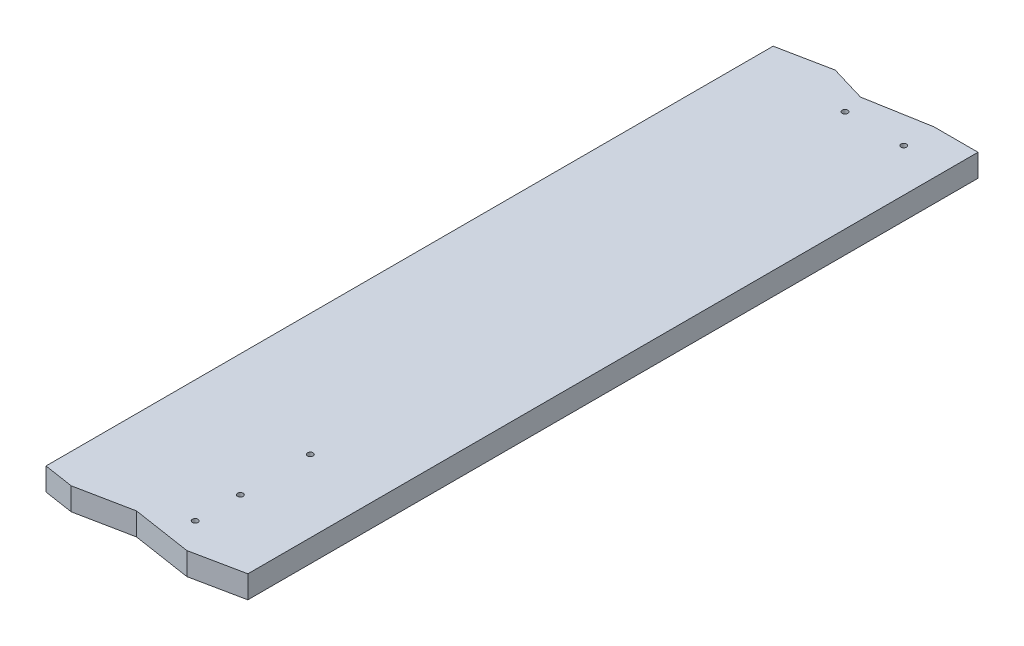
ISO-10303-21;
HEADER;
FILE_DESCRIPTION(('STEP AP214'),'2;1');
FILE_NAME('part.step','',(''),(''),'','','');
FILE_SCHEMA(('AUTOMOTIVE_DESIGN { 1 0 10303 214 1 1 1 1 }'));
ENDSEC;
DATA;
#1=APPLICATION_CONTEXT('core data for automotive mechanical design processes');
#2=APPLICATION_PROTOCOL_DEFINITION('international standard','automotive_design',2000,#1);
#3=PRODUCT_CONTEXT('',#1,'mechanical');
#4=PRODUCT('Part','Part','',(#3));
#5=PRODUCT_RELATED_PRODUCT_CATEGORY('part','',(#4));
#6=PRODUCT_DEFINITION_FORMATION('','',#4);
#7=PRODUCT_DEFINITION_CONTEXT('part definition',#1,'design');
#8=PRODUCT_DEFINITION('design','',#6,#7);
#9=PRODUCT_DEFINITION_SHAPE('','',#8);
#10=(LENGTH_UNIT() NAMED_UNIT(*) SI_UNIT(.MILLI.,.METRE.));
#11=(NAMED_UNIT(*) PLANE_ANGLE_UNIT() SI_UNIT($,.RADIAN.));
#12=(NAMED_UNIT(*) SI_UNIT($,.STERADIAN.) SOLID_ANGLE_UNIT());
#13=UNCERTAINTY_MEASURE_WITH_UNIT(LENGTH_MEASURE(1.E-05),#10,'distance_accuracy_value','');
#14=(GEOMETRIC_REPRESENTATION_CONTEXT(3) GLOBAL_UNCERTAINTY_ASSIGNED_CONTEXT((#13)) GLOBAL_UNIT_ASSIGNED_CONTEXT((#10,
#11,#12)) REPRESENTATION_CONTEXT('',''));
#15=CARTESIAN_POINT('',(0.,0.,0.));
#16=DIRECTION('',(0.,0.,1.));
#17=DIRECTION('',(1.,0.,0.));
#18=AXIS2_PLACEMENT_3D('',#15,#16,#17);
#19=CARTESIAN_POINT('',(-33.7950142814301,10.,-299.265761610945));
#20=DIRECTION('',(1.,0.,0.));
#21=DIRECTION('',(0.,0.,-1.));
#22=AXIS2_PLACEMENT_3D('',#19,#20,#21);
#23=PLANE('',#22);
#24=DIRECTION('',(0.,0.,1.));
#25=VECTOR('',#24,1.);
#26=CARTESIAN_POINT('',(-33.7950142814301,0.,-299.265761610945));
#27=LINE('',#26,#25);
#28=CARTESIAN_POINT('',(-33.7950142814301,0.,-299.265761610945));
#29=VERTEX_POINT('',#28);
#30=CARTESIAN_POINT('',(-33.79501428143,0.,22.9572803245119));
#31=VERTEX_POINT('',#30);
#32=EDGE_CURVE('E139',#29,#31,#27,.T.);
#33=ORIENTED_EDGE('',*,*,#32,.T.);
#34=DIRECTION('',(0.,-1.,0.));
#35=VECTOR('',#34,1.);
#36=CARTESIAN_POINT('',(-33.79501428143,10.,22.9572803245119));
#37=LINE('',#36,#35);
#38=CARTESIAN_POINT('',(-33.79501428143,10.,22.9572803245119));
#39=VERTEX_POINT('',#38);
#40=EDGE_CURVE('E11',#39,#31,#37,.T.);
#41=ORIENTED_EDGE('',*,*,#40,.F.);
#42=DIRECTION('',(0.,0.,1.));
#43=VECTOR('',#42,1.);
#44=CARTESIAN_POINT('',(-33.7950142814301,10.,-299.265761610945));
#45=LINE('',#44,#43);
#46=CARTESIAN_POINT('',(-33.7950142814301,10.,-299.265761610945));
#47=VERTEX_POINT('',#46);
#48=EDGE_CURVE('E158',#47,#39,#45,.T.);
#49=ORIENTED_EDGE('',*,*,#48,.F.);
#50=DIRECTION('',(0.,-1.,0.));
#51=VECTOR('',#50,1.);
#52=CARTESIAN_POINT('',(-33.7950142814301,10.,-299.265761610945));
#53=LINE('',#52,#51);
#54=EDGE_CURVE('E135',#47,#29,#53,.T.);
#55=ORIENTED_EDGE('',*,*,#54,.T.);
#56=EDGE_LOOP('',(#33,#41,#49,#55));
#57=FACE_BOUND('',#56,.T.);
#58=ADVANCED_FACE('F31',(#57),#23,.F.);
#59=CARTESIAN_POINT('',(-33.79501428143,10.,22.9572803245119));
#60=DIRECTION('',(0.152057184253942,0.,-0.988371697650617));
#61=DIRECTION('',(-0.988371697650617,0.,-0.152057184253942));
#62=AXIS2_PLACEMENT_3D('',#59,#60,#61);
#63=PLANE('',#62);
#64=DIRECTION('',(0.988371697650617,0.,0.152057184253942));
#65=VECTOR('',#64,1.);
#66=CARTESIAN_POINT('',(-33.79501428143,0.,22.9572803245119));
#67=LINE('',#66,#65);
#68=CARTESIAN_POINT('',(-20.6243887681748,0.,24.9835304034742));
#69=VERTEX_POINT('',#68);
#70=EDGE_CURVE('E142',#31,#69,#67,.T.);
#71=ORIENTED_EDGE('',*,*,#70,.T.);
#72=DIRECTION('',(0.,-1.,0.));
#73=VECTOR('',#72,1.);
#74=CARTESIAN_POINT('',(-20.6243887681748,10.,24.9835304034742));
#75=LINE('',#74,#73);
#76=CARTESIAN_POINT('',(-20.6243887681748,10.,24.9835304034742));
#77=VERTEX_POINT('',#76);
#78=EDGE_CURVE('E39',#77,#69,#75,.T.);
#79=ORIENTED_EDGE('',*,*,#78,.F.);
#80=DIRECTION('',(0.988371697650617,0.,0.152057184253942));
#81=VECTOR('',#80,1.);
#82=CARTESIAN_POINT('',(-33.79501428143,10.,22.9572803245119));
#83=LINE('',#82,#81);
#84=EDGE_CURVE('E96',#39,#77,#83,.T.);
#85=ORIENTED_EDGE('',*,*,#84,.F.);
#86=ORIENTED_EDGE('',*,*,#40,.T.);
#87=EDGE_LOOP('',(#71,#79,#85,#86));
#88=FACE_BOUND('',#87,.T.);
#89=ADVANCED_FACE('F269',(#88),#63,.F.);
#90=CARTESIAN_POINT('',(-20.6243887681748,10.,24.9835304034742));
#91=DIRECTION('',(-0.196116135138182,0.,-0.980580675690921));
#92=DIRECTION('',(-0.980580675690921,0.,0.196116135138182));
#93=AXIS2_PLACEMENT_3D('',#90,#91,#92);
#94=PLANE('',#93);
#95=DIRECTION('',(0.980580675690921,0.,-0.196116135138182));
#96=VECTOR('',#95,1.);
#97=CARTESIAN_POINT('',(-20.6243887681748,0.,24.9835304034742));
#98=LINE('',#97,#96);
#99=CARTESIAN_POINT('',(3.5171781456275,0.,20.1552170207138));
#100=VERTEX_POINT('',#99);
#101=EDGE_CURVE('E145',#69,#100,#98,.T.);
#102=ORIENTED_EDGE('',*,*,#101,.T.);
#103=DIRECTION('',(0.,-1.,0.));
#104=VECTOR('',#103,1.);
#105=CARTESIAN_POINT('',(3.5171781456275,10.,20.1552170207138));
#106=LINE('',#105,#104);
#107=CARTESIAN_POINT('',(3.5171781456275,10.,20.1552170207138));
#108=VERTEX_POINT('',#107);
#109=EDGE_CURVE('E171',#108,#100,#106,.T.);
#110=ORIENTED_EDGE('',*,*,#109,.F.);
#111=DIRECTION('',(0.980580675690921,0.,-0.196116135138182));
#112=VECTOR('',#111,1.);
#113=CARTESIAN_POINT('',(-20.6243887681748,10.,24.9835304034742));
#114=LINE('',#113,#112);
#115=EDGE_CURVE('E179',#77,#108,#114,.T.);
#116=ORIENTED_EDGE('',*,*,#115,.F.);
#117=ORIENTED_EDGE('',*,*,#78,.T.);
#118=EDGE_LOOP('',(#102,#110,#116,#117));
#119=FACE_BOUND('',#118,.T.);
#120=ADVANCED_FACE('F177',(#119),#94,.F.);
#121=CARTESIAN_POINT('',(3.5171781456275,10.,20.1552170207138));
#122=DIRECTION('',(0.152057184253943,0.,-0.988371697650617));
#123=DIRECTION('',(-0.988371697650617,0.,-0.152057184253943));
#124=AXIS2_PLACEMENT_3D('',#121,#122,#123);
#125=PLANE('',#124);
#126=DIRECTION('',(0.988371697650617,0.,0.152057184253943));
#127=VECTOR('',#126,1.);
#128=CARTESIAN_POINT('',(3.5171781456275,0.,20.1552170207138));
#129=LINE('',#128,#127);
#130=CARTESIAN_POINT('',(29.8890223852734,0.,24.2124238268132));
#131=VERTEX_POINT('',#130);
#132=EDGE_CURVE('E147',#100,#131,#129,.T.);
#133=ORIENTED_EDGE('',*,*,#132,.T.);
#134=DIRECTION('',(0.,-1.,0.));
#135=VECTOR('',#134,1.);
#136=CARTESIAN_POINT('',(29.8890223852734,10.,24.2124238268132));
#137=LINE('',#136,#135);
#138=CARTESIAN_POINT('',(29.8890223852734,10.,24.2124238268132));
#139=VERTEX_POINT('',#138);
#140=EDGE_CURVE('E168',#139,#131,#137,.T.);
#141=ORIENTED_EDGE('',*,*,#140,.F.);
#142=DIRECTION('',(0.988371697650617,0.,0.152057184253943));
#143=VECTOR('',#142,1.);
#144=CARTESIAN_POINT('',(3.5171781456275,10.,20.1552170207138));
#145=LINE('',#144,#143);
#146=EDGE_CURVE('E197',#108,#139,#145,.T.);
#147=ORIENTED_EDGE('',*,*,#146,.F.);
#148=ORIENTED_EDGE('',*,*,#109,.T.);
#149=EDGE_LOOP('',(#133,#141,#147,#148));
#150=FACE_BOUND('',#149,.T.);
#151=ADVANCED_FACE('F188',(#150),#125,.F.);
#152=CARTESIAN_POINT('',(29.8890223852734,10.,24.2124238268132));
#153=DIRECTION('',(-0.200946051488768,0.,-0.979602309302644));
#154=DIRECTION('',(-0.979602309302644,0.,0.200946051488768));
#155=AXIS2_PLACEMENT_3D('',#152,#153,#154);
#156=PLANE('',#155);
#157=DIRECTION('',(0.979602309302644,0.,-0.200946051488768));
#158=VECTOR('',#157,1.);
#159=CARTESIAN_POINT('',(29.8890223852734,0.,24.2124238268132));
#160=LINE('',#159,#158);
#161=CARTESIAN_POINT('',(52.3194629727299,0.,19.6112622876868));
#162=VERTEX_POINT('',#161);
#163=EDGE_CURVE('E149',#131,#162,#160,.T.);
#164=ORIENTED_EDGE('',*,*,#163,.T.);
#165=DIRECTION('',(0.,-1.,0.));
#166=VECTOR('',#165,1.);
#167=CARTESIAN_POINT('',(52.3194629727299,10.,19.6112622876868));
#168=LINE('',#167,#166);
#169=CARTESIAN_POINT('',(52.3194629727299,10.,19.6112622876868));
#170=VERTEX_POINT('',#169);
#171=EDGE_CURVE('E165',#170,#162,#168,.T.);
#172=ORIENTED_EDGE('',*,*,#171,.F.);
#173=DIRECTION('',(0.979602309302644,0.,-0.200946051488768));
#174=VECTOR('',#173,1.);
#175=CARTESIAN_POINT('',(29.8890223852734,10.,24.2124238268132));
#176=LINE('',#175,#174);
#177=EDGE_CURVE('E194',#139,#170,#176,.T.);
#178=ORIENTED_EDGE('',*,*,#177,.F.);
#179=ORIENTED_EDGE('',*,*,#140,.T.);
#180=EDGE_LOOP('',(#164,#172,#178,#179));
#181=FACE_BOUND('',#180,.T.);
#182=ADVANCED_FACE('F192',(#181),#156,.F.);
#183=CARTESIAN_POINT('',(52.3194629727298,10.,-303.947835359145));
#184=DIRECTION('',(-1.,0.,0.));
#185=DIRECTION('',(0.,0.,1.));
#186=AXIS2_PLACEMENT_3D('',#183,#184,#185);
#187=PLANE('',#186);
#188=DIRECTION('',(0.,0.,-1.));
#189=VECTOR('',#188,1.);
#190=CARTESIAN_POINT('',(52.3194629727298,0.,-303.947835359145));
#191=LINE('',#190,#189);
#192=CARTESIAN_POINT('',(52.3194629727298,0.,-303.947835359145));
#193=VERTEX_POINT('',#192);
#194=EDGE_CURVE('E151',#162,#193,#191,.T.);
#195=ORIENTED_EDGE('',*,*,#194,.T.);
#196=DIRECTION('',(0.,-1.,0.));
#197=VECTOR('',#196,1.);
#198=CARTESIAN_POINT('',(52.3194629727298,10.,-303.947835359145));
#199=LINE('',#198,#197);
#200=CARTESIAN_POINT('',(52.3194629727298,10.,-303.947835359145));
#201=VERTEX_POINT('',#200);
#202=EDGE_CURVE('E162',#201,#193,#199,.T.);
#203=ORIENTED_EDGE('',*,*,#202,.F.);
#204=DIRECTION('',(0.,0.,-1.));
#205=VECTOR('',#204,1.);
#206=CARTESIAN_POINT('',(52.3194629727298,10.,-303.947835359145));
#207=LINE('',#206,#205);
#208=EDGE_CURVE('E196',#170,#201,#207,.T.);
#209=ORIENTED_EDGE('',*,*,#208,.F.);
#210=ORIENTED_EDGE('',*,*,#171,.T.);
#211=EDGE_LOOP('',(#195,#203,#209,#210));
#212=FACE_BOUND('',#211,.T.);
#213=ADVANCED_FACE('F281',(#212),#187,.F.);
#214=CARTESIAN_POINT('',(32.7417415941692,10.,-303.947835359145));
#215=DIRECTION('',(0.,0.,1.));
#216=DIRECTION('',(1.,0.,0.));
#217=AXIS2_PLACEMENT_3D('',#214,#215,#216);
#218=PLANE('',#217);
#219=DIRECTION('',(-1.,0.,0.));
#220=VECTOR('',#219,1.);
#221=CARTESIAN_POINT('',(32.7417415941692,0.,-303.947835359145));
#222=LINE('',#221,#220);
#223=CARTESIAN_POINT('',(32.7417415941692,0.,-303.947835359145));
#224=VERTEX_POINT('',#223);
#225=EDGE_CURVE('E153',#193,#224,#222,.T.);
#226=ORIENTED_EDGE('',*,*,#225,.T.);
#227=DIRECTION('',(0.,-1.,0.));
#228=VECTOR('',#227,1.);
#229=CARTESIAN_POINT('',(32.7417415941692,10.,-303.947835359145));
#230=LINE('',#229,#228);
#231=CARTESIAN_POINT('',(32.7417415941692,10.,-303.947835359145));
#232=VERTEX_POINT('',#231);
#233=EDGE_CURVE('E130',#232,#224,#230,.T.);
#234=ORIENTED_EDGE('',*,*,#233,.F.);
#235=DIRECTION('',(-1.,0.,0.));
#236=VECTOR('',#235,1.);
#237=CARTESIAN_POINT('',(32.7417415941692,10.,-303.947835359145));
#238=LINE('',#237,#236);
#239=EDGE_CURVE('E121',#201,#232,#238,.T.);
#240=ORIENTED_EDGE('',*,*,#239,.F.);
#241=ORIENTED_EDGE('',*,*,#202,.T.);
#242=EDGE_LOOP('',(#226,#234,#240,#241));
#243=FACE_BOUND('',#242,.T.);
#244=ADVANCED_FACE('F278',(#243),#218,.F.);
#245=CARTESIAN_POINT('',(5.08827752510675,10.,-299.08082568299));
#246=DIRECTION('',(0.173335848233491,0.,0.984862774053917));
#247=DIRECTION('',(0.984862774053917,0.,-0.173335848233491));
#248=AXIS2_PLACEMENT_3D('',#245,#246,#247);
#249=PLANE('',#248);
#250=DIRECTION('',(-0.984862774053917,0.,0.173335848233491));
#251=VECTOR('',#250,1.);
#252=CARTESIAN_POINT('',(5.08827752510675,0.,-299.08082568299));
#253=LINE('',#252,#251);
#254=CARTESIAN_POINT('',(5.08827752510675,0.,-299.08082568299));
#255=VERTEX_POINT('',#254);
#256=EDGE_CURVE('E129',#224,#255,#253,.T.);
#257=ORIENTED_EDGE('',*,*,#256,.T.);
#258=DIRECTION('',(0.,-1.,0.));
#259=VECTOR('',#258,1.);
#260=CARTESIAN_POINT('',(5.08827752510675,10.,-299.08082568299));
#261=LINE('',#260,#259);
#262=CARTESIAN_POINT('',(5.08827752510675,10.,-299.08082568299));
#263=VERTEX_POINT('',#262);
#264=EDGE_CURVE('E126',#263,#255,#261,.T.);
#265=ORIENTED_EDGE('',*,*,#264,.F.);
#266=DIRECTION('',(-0.984862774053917,0.,0.173335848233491));
#267=VECTOR('',#266,1.);
#268=CARTESIAN_POINT('',(5.08827752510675,10.,-299.08082568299));
#269=LINE('',#268,#267);
#270=EDGE_CURVE('E115',#232,#263,#269,.T.);
#271=ORIENTED_EDGE('',*,*,#270,.F.);
#272=ORIENTED_EDGE('',*,*,#233,.T.);
#273=EDGE_LOOP('',(#257,#265,#271,#272));
#274=FACE_BOUND('',#273,.T.);
#275=ADVANCED_FACE('F127',(#274),#249,.F.);
#276=CARTESIAN_POINT('',(-10.8600264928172,10.,-303.852759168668));
#277=DIRECTION('',(-0.286655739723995,0.,0.958033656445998));
#278=DIRECTION('',(0.958033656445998,0.,0.286655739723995));
#279=AXIS2_PLACEMENT_3D('',#276,#277,#278);
#280=PLANE('',#279);
#281=DIRECTION('',(-0.958033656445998,0.,-0.286655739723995));
#282=VECTOR('',#281,1.);
#283=CARTESIAN_POINT('',(-10.8600264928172,0.,-303.852759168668));
#284=LINE('',#283,#282);
#285=CARTESIAN_POINT('',(-10.8600264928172,0.,-303.852759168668));
#286=VERTEX_POINT('',#285);
#287=EDGE_CURVE('E82',#255,#286,#284,.T.);
#288=ORIENTED_EDGE('',*,*,#287,.T.);
#289=DIRECTION('',(0.,-1.,0.));
#290=VECTOR('',#289,1.);
#291=CARTESIAN_POINT('',(-10.8600264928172,10.,-303.852759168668));
#292=LINE('',#291,#290);
#293=CARTESIAN_POINT('',(-10.8600264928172,10.,-303.852759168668));
#294=VERTEX_POINT('',#293);
#295=EDGE_CURVE('E131',#294,#286,#292,.T.);
#296=ORIENTED_EDGE('',*,*,#295,.F.);
#297=DIRECTION('',(-0.958033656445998,0.,-0.286655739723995));
#298=VECTOR('',#297,1.);
#299=CARTESIAN_POINT('',(-10.8600264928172,10.,-303.852759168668));
#300=LINE('',#299,#298);
#301=EDGE_CURVE('E119',#263,#294,#300,.T.);
#302=ORIENTED_EDGE('',*,*,#301,.F.);
#303=ORIENTED_EDGE('',*,*,#264,.T.);
#304=EDGE_LOOP('',(#288,#296,#302,#303));
#305=FACE_BOUND('',#304,.T.);
#306=ADVANCED_FACE('F133',(#305),#280,.F.);
#307=CARTESIAN_POINT('',(-33.7950142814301,10.,-299.265761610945));
#308=DIRECTION('',(0.196116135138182,0.,0.980580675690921));
#309=DIRECTION('',(0.980580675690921,0.,-0.196116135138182));
#310=AXIS2_PLACEMENT_3D('',#307,#308,#309);
#311=PLANE('',#310);
#312=DIRECTION('',(-0.980580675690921,0.,0.196116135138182));
#313=VECTOR('',#312,1.);
#314=CARTESIAN_POINT('',(-33.7950142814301,0.,-299.265761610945));
#315=LINE('',#314,#313);
#316=EDGE_CURVE('E88',#286,#29,#315,.T.);
#317=ORIENTED_EDGE('',*,*,#316,.T.);
#318=ORIENTED_EDGE('',*,*,#54,.F.);
#319=DIRECTION('',(-0.980580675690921,0.,0.196116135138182));
#320=VECTOR('',#319,1.);
#321=CARTESIAN_POINT('',(-33.7950142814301,10.,-299.265761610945));
#322=LINE('',#321,#320);
#323=EDGE_CURVE('E47',#294,#47,#322,.T.);
#324=ORIENTED_EDGE('',*,*,#323,.F.);
#325=ORIENTED_EDGE('',*,*,#295,.T.);
#326=EDGE_LOOP('',(#317,#318,#324,#325));
#327=FACE_BOUND('',#326,.T.);
#328=ADVANCED_FACE('F333',(#327),#311,.F.);
#329=CARTESIAN_POINT('',(-33.79501428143,10.,-303.947835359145));
#330=DIRECTION('',(0.,1.,0.));
#331=DIRECTION('',(0.,0.,1.));
#332=AXIS2_PLACEMENT_3D('',#329,#330,#331);
#333=PLANE('',#332);
#334=CARTESIAN_POINT('',(7.3194629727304,10.,-290.042719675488));
#335=DIRECTION('',(0.,-1.,0.));
#336=DIRECTION('',(0.,0.,-1.));
#337=AXIS2_PLACEMENT_3D('',#334,#335,#336);
#338=CIRCLE('',#337,1.25);
#339=CARTESIAN_POINT('',(7.3194629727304,10.,-291.292719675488));
#340=VERTEX_POINT('',#339);
#341=EDGE_CURVE('E226',#340,#340,#338,.T.);
#342=ORIENTED_EDGE('',*,*,#341,.T.);
#343=EDGE_LOOP('',(#342));
#344=FACE_BOUND('',#343,.T.);
#345=CARTESIAN_POINT('',(20.3194629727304,10.,-40.0427196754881));
#346=DIRECTION('',(0.,-1.,0.));
#347=DIRECTION('',(0.,0.,-1.));
#348=AXIS2_PLACEMENT_3D('',#345,#346,#347);
#349=CIRCLE('',#348,1.24999999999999);
#350=CARTESIAN_POINT('',(20.3194629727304,10.,-41.2927196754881));
#351=VERTEX_POINT('',#350);
#352=EDGE_CURVE('E220',#351,#351,#349,.T.);
#353=ORIENTED_EDGE('',*,*,#352,.T.);
#354=EDGE_LOOP('',(#353));
#355=FACE_BOUND('',#354,.T.);
#356=CARTESIAN_POINT('',(20.3194629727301,10.,-9.04271967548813));
#357=DIRECTION('',(0.,-1.,0.));
#358=DIRECTION('',(0.,0.,-1.));
#359=AXIS2_PLACEMENT_3D('',#356,#357,#358);
#360=CIRCLE('',#359,1.25);
#361=CARTESIAN_POINT('',(20.3194629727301,10.,-10.2927196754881));
#362=VERTEX_POINT('',#361);
#363=EDGE_CURVE('E214',#362,#362,#360,.T.);
#364=ORIENTED_EDGE('',*,*,#363,.T.);
#365=EDGE_LOOP('',(#364));
#366=FACE_BOUND('',#365,.T.);
#367=CARTESIAN_POINT('',(20.3194629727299,10.,10.9572803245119));
#368=DIRECTION('',(0.,-1.,0.));
#369=DIRECTION('',(0.,0.,-1.));
#370=AXIS2_PLACEMENT_3D('',#367,#368,#369);
#371=CIRCLE('',#370,1.25);
#372=CARTESIAN_POINT('',(20.3194629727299,10.,9.70728032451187));
#373=VERTEX_POINT('',#372);
#374=EDGE_CURVE('E208',#373,#373,#371,.T.);
#375=ORIENTED_EDGE('',*,*,#374,.T.);
#376=EDGE_LOOP('',(#375));
#377=FACE_BOUND('',#376,.T.);
#378=CARTESIAN_POINT('',(33.3194629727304,10.,-290.042719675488));
#379=DIRECTION('',(0.,-1.,0.));
#380=DIRECTION('',(0.,0.,-1.));
#381=AXIS2_PLACEMENT_3D('',#378,#379,#380);
#382=CIRCLE('',#381,1.25);
#383=CARTESIAN_POINT('',(33.3194629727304,10.,-291.292719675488));
#384=VERTEX_POINT('',#383);
#385=EDGE_CURVE('E143',#384,#384,#382,.T.);
#386=ORIENTED_EDGE('',*,*,#385,.T.);
#387=EDGE_LOOP('',(#386));
#388=FACE_BOUND('',#387,.T.);
#389=ORIENTED_EDGE('',*,*,#48,.T.);
#390=ORIENTED_EDGE('',*,*,#84,.T.);
#391=ORIENTED_EDGE('',*,*,#115,.T.);
#392=ORIENTED_EDGE('',*,*,#146,.T.);
#393=ORIENTED_EDGE('',*,*,#177,.T.);
#394=ORIENTED_EDGE('',*,*,#208,.T.);
#395=ORIENTED_EDGE('',*,*,#239,.T.);
#396=ORIENTED_EDGE('',*,*,#270,.T.);
#397=ORIENTED_EDGE('',*,*,#301,.T.);
#398=ORIENTED_EDGE('',*,*,#323,.T.);
#399=EDGE_LOOP('',(#389,#390,#391,#392,#393,#394,#395,#396,#397,#398));
#400=FACE_BOUND('',#399,.T.);
#401=ADVANCED_FACE('F117',(#344,#355,#366,#377,#388,#400),#333,.T.);
#402=CARTESIAN_POINT('',(-33.79501428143,0.,-303.947835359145));
#403=DIRECTION('',(0.,1.,0.));
#404=DIRECTION('',(0.,0.,1.));
#405=AXIS2_PLACEMENT_3D('',#402,#403,#404);
#406=PLANE('',#405);
#407=CARTESIAN_POINT('',(7.3194629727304,0.,-290.042719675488));
#408=DIRECTION('',(0.,-1.,0.));
#409=DIRECTION('',(0.,0.,-1.));
#410=AXIS2_PLACEMENT_3D('',#407,#408,#409);
#411=CIRCLE('',#410,1.25);
#412=CARTESIAN_POINT('',(7.3194629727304,0.,-291.292719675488));
#413=VERTEX_POINT('',#412);
#414=EDGE_CURVE('E229',#413,#413,#411,.T.);
#415=ORIENTED_EDGE('',*,*,#414,.F.);
#416=EDGE_LOOP('',(#415));
#417=FACE_BOUND('',#416,.T.);
#418=CARTESIAN_POINT('',(20.3194629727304,0.,-40.0427196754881));
#419=DIRECTION('',(0.,-1.,0.));
#420=DIRECTION('',(0.,0.,-1.));
#421=AXIS2_PLACEMENT_3D('',#418,#419,#420);
#422=CIRCLE('',#421,1.24999999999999);
#423=CARTESIAN_POINT('',(20.3194629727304,0.,-41.2927196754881));
#424=VERTEX_POINT('',#423);
#425=EDGE_CURVE('E223',#424,#424,#422,.T.);
#426=ORIENTED_EDGE('',*,*,#425,.F.);
#427=EDGE_LOOP('',(#426));
#428=FACE_BOUND('',#427,.T.);
#429=CARTESIAN_POINT('',(20.3194629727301,0.,-9.04271967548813));
#430=DIRECTION('',(0.,-1.,0.));
#431=DIRECTION('',(0.,0.,-1.));
#432=AXIS2_PLACEMENT_3D('',#429,#430,#431);
#433=CIRCLE('',#432,1.25);
#434=CARTESIAN_POINT('',(20.3194629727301,0.,-10.2927196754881));
#435=VERTEX_POINT('',#434);
#436=EDGE_CURVE('E217',#435,#435,#433,.T.);
#437=ORIENTED_EDGE('',*,*,#436,.F.);
#438=EDGE_LOOP('',(#437));
#439=FACE_BOUND('',#438,.T.);
#440=CARTESIAN_POINT('',(20.3194629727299,0.,10.9572803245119));
#441=DIRECTION('',(0.,-1.,0.));
#442=DIRECTION('',(0.,0.,-1.));
#443=AXIS2_PLACEMENT_3D('',#440,#441,#442);
#444=CIRCLE('',#443,1.25);
#445=CARTESIAN_POINT('',(20.3194629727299,0.,9.70728032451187));
#446=VERTEX_POINT('',#445);
#447=EDGE_CURVE('E211',#446,#446,#444,.T.);
#448=ORIENTED_EDGE('',*,*,#447,.F.);
#449=EDGE_LOOP('',(#448));
#450=FACE_BOUND('',#449,.T.);
#451=CARTESIAN_POINT('',(33.3194629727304,0.,-290.042719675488));
#452=DIRECTION('',(0.,-1.,0.));
#453=DIRECTION('',(0.,0.,-1.));
#454=AXIS2_PLACEMENT_3D('',#451,#452,#453);
#455=CIRCLE('',#454,1.25);
#456=CARTESIAN_POINT('',(33.3194629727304,0.,-291.292719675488));
#457=VERTEX_POINT('',#456);
#458=EDGE_CURVE('E205',#457,#457,#455,.T.);
#459=ORIENTED_EDGE('',*,*,#458,.F.);
#460=EDGE_LOOP('',(#459));
#461=FACE_BOUND('',#460,.T.);
#462=ORIENTED_EDGE('',*,*,#32,.F.);
#463=ORIENTED_EDGE('',*,*,#316,.F.);
#464=ORIENTED_EDGE('',*,*,#287,.F.);
#465=ORIENTED_EDGE('',*,*,#256,.F.);
#466=ORIENTED_EDGE('',*,*,#225,.F.);
#467=ORIENTED_EDGE('',*,*,#194,.F.);
#468=ORIENTED_EDGE('',*,*,#163,.F.);
#469=ORIENTED_EDGE('',*,*,#132,.F.);
#470=ORIENTED_EDGE('',*,*,#101,.F.);
#471=ORIENTED_EDGE('',*,*,#70,.F.);
#472=EDGE_LOOP('',(#462,#463,#464,#465,#466,#467,#468,#469,#470,#471));
#473=FACE_BOUND('',#472,.T.);
#474=ADVANCED_FACE('F183',(#417,#428,#439,#450,#461,#473),#406,.F.);
#475=CARTESIAN_POINT('',(33.3194629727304,10.,-290.042719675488));
#476=DIRECTION('',(0.,-1.,0.));
#477=DIRECTION('',(0.,0.,-1.));
#478=AXIS2_PLACEMENT_3D('',#475,#476,#477);
#479=CYLINDRICAL_SURFACE('',#478,1.25);
#480=ORIENTED_EDGE('',*,*,#385,.F.);
#481=EDGE_LOOP('',(#480));
#482=FACE_BOUND('',#481,.T.);
#483=ORIENTED_EDGE('',*,*,#458,.T.);
#484=EDGE_LOOP('',(#483));
#485=FACE_BOUND('',#484,.T.);
#486=ADVANCED_FACE('F246',(#482,#485),#479,.F.);
#487=CARTESIAN_POINT('',(20.3194629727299,10.,10.9572803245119));
#488=DIRECTION('',(0.,-1.,0.));
#489=DIRECTION('',(0.,0.,-1.));
#490=AXIS2_PLACEMENT_3D('',#487,#488,#489);
#491=CYLINDRICAL_SURFACE('',#490,1.25);
#492=ORIENTED_EDGE('',*,*,#374,.F.);
#493=EDGE_LOOP('',(#492));
#494=FACE_BOUND('',#493,.T.);
#495=ORIENTED_EDGE('',*,*,#447,.T.);
#496=EDGE_LOOP('',(#495));
#497=FACE_BOUND('',#496,.T.);
#498=ADVANCED_FACE('F257',(#494,#497),#491,.F.);
#499=CARTESIAN_POINT('',(20.3194629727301,10.,-9.04271967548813));
#500=DIRECTION('',(0.,-1.,0.));
#501=DIRECTION('',(0.,0.,-1.));
#502=AXIS2_PLACEMENT_3D('',#499,#500,#501);
#503=CYLINDRICAL_SURFACE('',#502,1.25);
#504=ORIENTED_EDGE('',*,*,#363,.F.);
#505=EDGE_LOOP('',(#504));
#506=FACE_BOUND('',#505,.T.);
#507=ORIENTED_EDGE('',*,*,#436,.T.);
#508=EDGE_LOOP('',(#507));
#509=FACE_BOUND('',#508,.T.);
#510=ADVANCED_FACE('F263',(#506,#509),#503,.F.);
#511=CARTESIAN_POINT('',(20.3194629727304,10.,-40.0427196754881));
#512=DIRECTION('',(0.,-1.,0.));
#513=DIRECTION('',(0.,0.,-1.));
#514=AXIS2_PLACEMENT_3D('',#511,#512,#513);
#515=CYLINDRICAL_SURFACE('',#514,1.24999999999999);
#516=ORIENTED_EDGE('',*,*,#352,.F.);
#517=EDGE_LOOP('',(#516));
#518=FACE_BOUND('',#517,.T.);
#519=ORIENTED_EDGE('',*,*,#425,.T.);
#520=EDGE_LOOP('',(#519));
#521=FACE_BOUND('',#520,.T.);
#522=ADVANCED_FACE('F240',(#518,#521),#515,.F.);
#523=CARTESIAN_POINT('',(7.3194629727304,10.,-290.042719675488));
#524=DIRECTION('',(0.,-1.,0.));
#525=DIRECTION('',(0.,0.,-1.));
#526=AXIS2_PLACEMENT_3D('',#523,#524,#525);
#527=CYLINDRICAL_SURFACE('',#526,1.25);
#528=ORIENTED_EDGE('',*,*,#341,.F.);
#529=EDGE_LOOP('',(#528));
#530=FACE_BOUND('',#529,.T.);
#531=ORIENTED_EDGE('',*,*,#414,.T.);
#532=EDGE_LOOP('',(#531));
#533=FACE_BOUND('',#532,.T.);
#534=ADVANCED_FACE('F237',(#530,#533),#527,.F.);
#535=CLOSED_SHELL('',(#58,#89,#120,#151,#182,#213,#244,#275,#306,#328,#401,#474,#486,#498,#510,
#522,#534));
#536=MANIFOLD_SOLID_BREP('B2',#535);
#537=ADVANCED_BREP_SHAPE_REPRESENTATION('',(#18,#536),#14);
#538=SHAPE_DEFINITION_REPRESENTATION(#9,#537);
ENDSEC;
END-ISO-10303-21;
